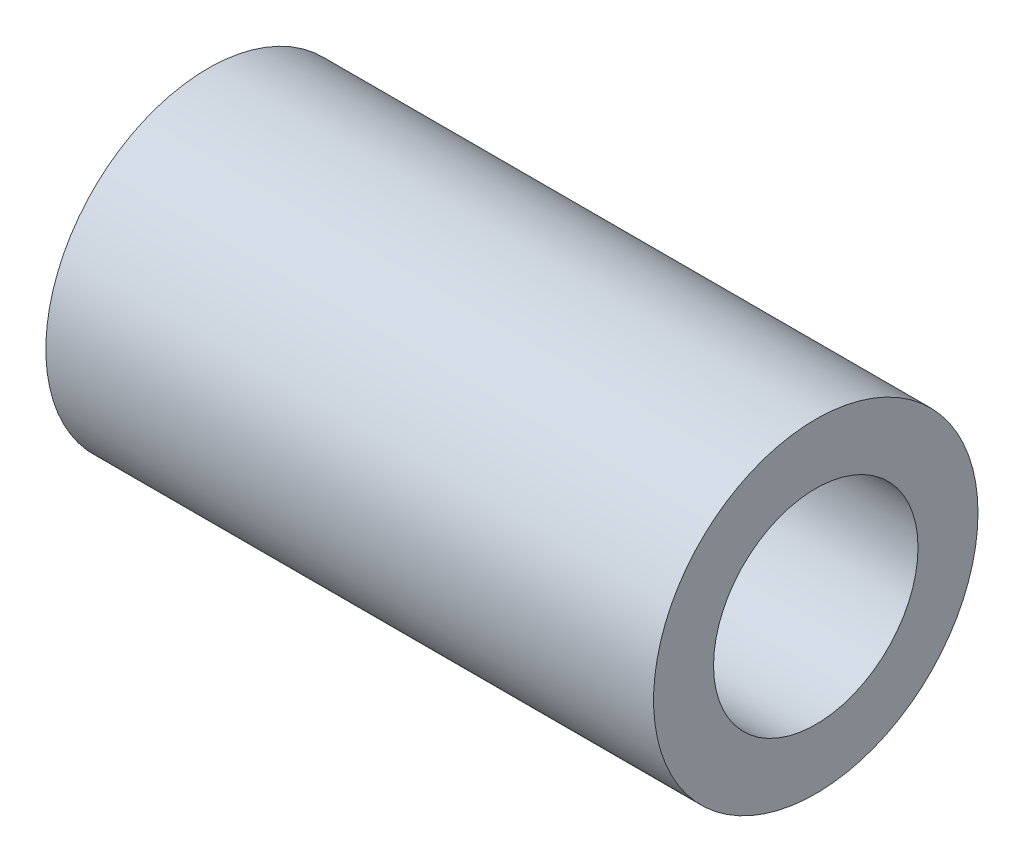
ISO-10303-21;
HEADER;
FILE_DESCRIPTION(('STEP AP214'),'2;1');
FILE_NAME('part.step','',(''),(''),'','','');
FILE_SCHEMA(('AUTOMOTIVE_DESIGN { 1 0 10303 214 1 1 1 1 }'));
ENDSEC;
DATA;
#1=APPLICATION_CONTEXT('core data for automotive mechanical design processes');
#2=APPLICATION_PROTOCOL_DEFINITION('international standard','automotive_design',2000,#1);
#3=PRODUCT_CONTEXT('',#1,'mechanical');
#4=PRODUCT('Part','Part','',(#3));
#5=PRODUCT_RELATED_PRODUCT_CATEGORY('part','',(#4));
#6=PRODUCT_DEFINITION_FORMATION('','',#4);
#7=PRODUCT_DEFINITION_CONTEXT('part definition',#1,'design');
#8=PRODUCT_DEFINITION('design','',#6,#7);
#9=PRODUCT_DEFINITION_SHAPE('','',#8);
#10=(LENGTH_UNIT() NAMED_UNIT(*) SI_UNIT(.MILLI.,.METRE.));
#11=(NAMED_UNIT(*) PLANE_ANGLE_UNIT() SI_UNIT($,.RADIAN.));
#12=(NAMED_UNIT(*) SI_UNIT($,.STERADIAN.) SOLID_ANGLE_UNIT());
#13=UNCERTAINTY_MEASURE_WITH_UNIT(LENGTH_MEASURE(1.E-05),#10,'distance_accuracy_value','');
#14=(GEOMETRIC_REPRESENTATION_CONTEXT(3) GLOBAL_UNCERTAINTY_ASSIGNED_CONTEXT((#13)) GLOBAL_UNIT_ASSIGNED_CONTEXT((#10,
#11,#12)) REPRESENTATION_CONTEXT('',''));
#15=CARTESIAN_POINT('',(0.,0.,0.));
#16=DIRECTION('',(0.,0.,1.));
#17=DIRECTION('',(1.,0.,0.));
#18=AXIS2_PLACEMENT_3D('',#15,#16,#17);
#19=CARTESIAN_POINT('',(28.3083,0.,0.));
#20=DIRECTION('',(1.,0.,0.));
#21=DIRECTION('',(0.,0.,-1.));
#22=AXIS2_PLACEMENT_3D('',#19,#20,#21);
#23=PLANE('',#22);
#24=CARTESIAN_POINT('',(28.3083,0.,0.));
#25=DIRECTION('',(1.,0.,0.));
#26=DIRECTION('',(0.,0.,-1.));
#27=AXIS2_PLACEMENT_3D('',#24,#25,#26);
#28=CIRCLE('',#27,15.113);
#29=CARTESIAN_POINT('',(28.3083,0.,-15.113));
#30=VERTEX_POINT('',#29);
#31=EDGE_CURVE('E12',#30,#30,#28,.T.);
#32=ORIENTED_EDGE('',*,*,#31,.T.);
#33=EDGE_LOOP('',(#32));
#34=FACE_BOUND('',#33,.T.);
#35=CARTESIAN_POINT('',(28.3083,0.,0.));
#36=DIRECTION('',(1.,0.,0.));
#37=DIRECTION('',(0.,0.,-1.));
#38=AXIS2_PLACEMENT_3D('',#35,#36,#37);
#39=CIRCLE('',#38,9.525);
#40=CARTESIAN_POINT('',(28.3083,0.,-9.525));
#41=VERTEX_POINT('',#40);
#42=EDGE_CURVE('E411',#41,#41,#39,.T.);
#43=ORIENTED_EDGE('',*,*,#42,.F.);
#44=EDGE_LOOP('',(#43));
#45=FACE_BOUND('',#44,.T.);
#46=ADVANCED_FACE('F400',(#34,#45),#23,.T.);
#47=CARTESIAN_POINT('',(-28.3083,0.,0.));
#48=DIRECTION('',(1.,0.,0.));
#49=DIRECTION('',(0.,0.,-1.));
#50=AXIS2_PLACEMENT_3D('',#47,#48,#49);
#51=PLANE('',#50);
#52=CARTESIAN_POINT('',(-28.3083,0.,0.));
#53=DIRECTION('',(1.,0.,0.));
#54=DIRECTION('',(0.,0.,-1.));
#55=AXIS2_PLACEMENT_3D('',#52,#53,#54);
#56=CIRCLE('',#55,15.113);
#57=CARTESIAN_POINT('',(-28.3083,0.,-15.113));
#58=VERTEX_POINT('',#57);
#59=EDGE_CURVE('E407',#58,#58,#56,.T.);
#60=ORIENTED_EDGE('',*,*,#59,.F.);
#61=EDGE_LOOP('',(#60));
#62=FACE_BOUND('',#61,.T.);
#63=CARTESIAN_POINT('',(-28.3083,0.,0.));
#64=DIRECTION('',(1.,0.,0.));
#65=DIRECTION('',(0.,0.,-1.));
#66=AXIS2_PLACEMENT_3D('',#63,#64,#65);
#67=CIRCLE('',#66,9.525);
#68=CARTESIAN_POINT('',(-28.3083,0.,-9.525));
#69=VERTEX_POINT('',#68);
#70=EDGE_CURVE('E415',#69,#69,#67,.T.);
#71=ORIENTED_EDGE('',*,*,#70,.T.);
#72=EDGE_LOOP('',(#71));
#73=FACE_BOUND('',#72,.T.);
#74=ADVANCED_FACE('F421',(#62,#73),#51,.F.);
#75=CARTESIAN_POINT('',(28.3083,0.,0.));
#76=DIRECTION('',(-1.,0.,0.));
#77=DIRECTION('',(0.,0.,1.));
#78=AXIS2_PLACEMENT_3D('',#75,#76,#77);
#79=CYLINDRICAL_SURFACE('',#78,15.113);
#80=ORIENTED_EDGE('',*,*,#31,.F.);
#81=EDGE_LOOP('',(#80));
#82=FACE_BOUND('',#81,.T.);
#83=ORIENTED_EDGE('',*,*,#59,.T.);
#84=EDGE_LOOP('',(#83));
#85=FACE_BOUND('',#84,.T.);
#86=ADVANCED_FACE('F402',(#82,#85),#79,.T.);
#87=CARTESIAN_POINT('',(28.3083,0.,0.));
#88=DIRECTION('',(-1.,0.,0.));
#89=DIRECTION('',(0.,0.,1.));
#90=AXIS2_PLACEMENT_3D('',#87,#88,#89);
#91=CYLINDRICAL_SURFACE('',#90,9.525);
#92=ORIENTED_EDGE('',*,*,#42,.T.);
#93=EDGE_LOOP('',(#92));
#94=FACE_BOUND('',#93,.T.);
#95=ORIENTED_EDGE('',*,*,#70,.F.);
#96=EDGE_LOOP('',(#95));
#97=FACE_BOUND('',#96,.T.);
#98=ADVANCED_FACE('F423',(#94,#97),#91,.F.);
#99=CLOSED_SHELL('',(#46,#74,#86,#98));
#100=MANIFOLD_SOLID_BREP('B2',#99);
#101=ADVANCED_BREP_SHAPE_REPRESENTATION('',(#18,#100),#14);
#102=SHAPE_DEFINITION_REPRESENTATION(#9,#101);
ENDSEC;
END-ISO-10303-21;
